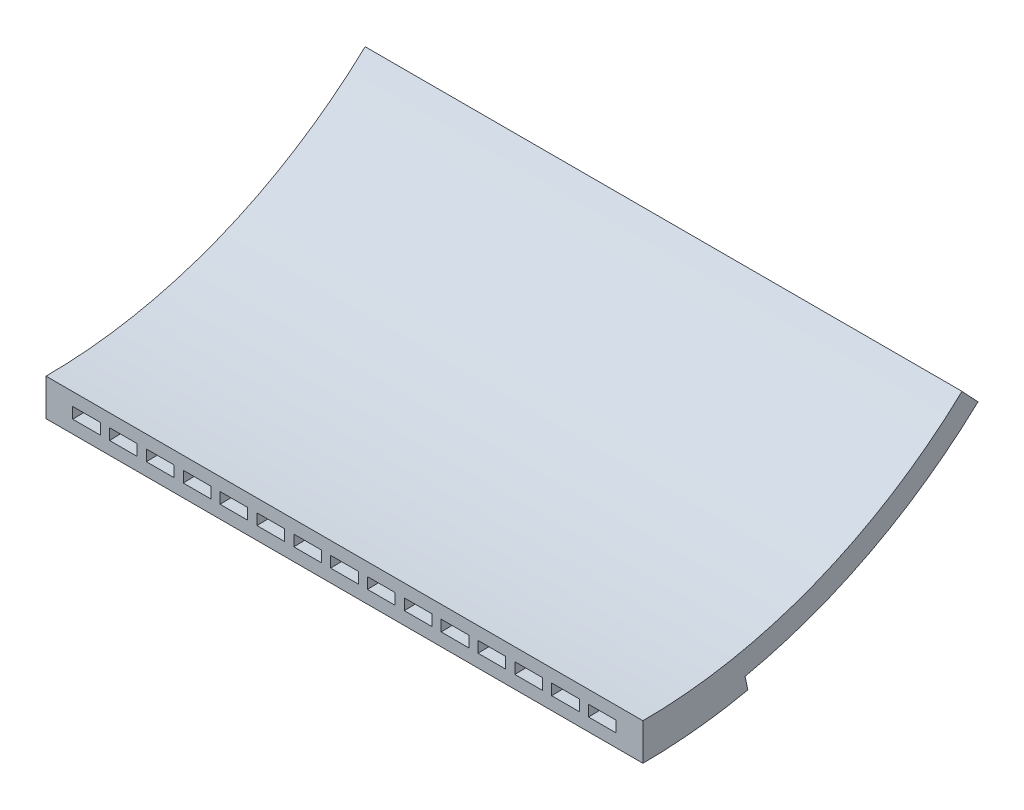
from build123d import *

# Parameters (mm, degrees)
SKICA1_W                 = 162
SKICA1_H                 = 10
SKICA1_W_2               = 7.5
SKICA1_H_2               = 3
ROTOVAT1_ANGLE           = 140
M_TKO1_SCALE             = 0.655
ODEBRAT_VYSUNUT_M1_DEPTH = 210.05737826
ODEBRAT_VYSUNUT_M2_DEPTH = 126.349441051


with BuildPart() as part:
    # Skica1 → Rotovat1 (revolve)
    with BuildSketch(Plane.XY):
        with Locations((73.75, 1.5)):
            Rectangle(SKICA1_W, SKICA1_H)
        with Locations((13.75, 1.5)):
            Rectangle(SKICA1_W_2, SKICA1_H_2, mode=Mode.SUBTRACT)
        with Locations((3.75, 1.5)):
            Rectangle(SKICA1_W_2, SKICA1_H_2, mode=Mode.SUBTRACT)
        with Locations((23.75, 1.5)):
            Rectangle(SKICA1_W_2, SKICA1_H_2, mode=Mode.SUBTRACT)
        with Locations((33.75, 1.5)):
            Rectangle(SKICA1_W_2, SKICA1_H_2, mode=Mode.SUBTRACT)
        with Locations((43.75, 1.5)):
            Rectangle(SKICA1_W_2, SKICA1_H_2, mode=Mode.SUBTRACT)
        with Locations((53.75, 1.5)):
            Rectangle(SKICA1_W_2, SKICA1_H_2, mode=Mode.SUBTRACT)
        with Locations((63.75, 1.5)):
            Rectangle(SKICA1_W_2, SKICA1_H_2, mode=Mode.SUBTRACT)
        with Locations((73.75, 1.5)):
            Rectangle(SKICA1_W_2, SKICA1_H_2, mode=Mode.SUBTRACT)
        with Locations((83.75, 1.5)):
            Rectangle(SKICA1_W_2, SKICA1_H_2, mode=Mode.SUBTRACT)
        with Locations((93.75, 1.5)):
            Rectangle(SKICA1_W_2, SKICA1_H_2, mode=Mode.SUBTRACT)
        with Locations((103.75, 1.5)):
            Rectangle(SKICA1_W_2, SKICA1_H_2, mode=Mode.SUBTRACT)
        with Locations((113.75, 1.5)):
            Rectangle(SKICA1_W_2, SKICA1_H_2, mode=Mode.SUBTRACT)
        with Locations((123.75, 1.5)):
            Rectangle(SKICA1_W_2, SKICA1_H_2, mode=Mode.SUBTRACT)
        with Locations((133.75, 1.5)):
            Rectangle(SKICA1_W_2, SKICA1_H_2, mode=Mode.SUBTRACT)
        with Locations((143.75, 1.5)):
            Rectangle(SKICA1_W_2, SKICA1_H_2, mode=Mode.SUBTRACT)
    revolve(axis=Axis((-7.25, 133.5, 0), (1, 0, 0)), revolution_arc=ROTOVAT1_ANGLE)


with BuildPart() as part_1:
    # M_tko1: scaled about (0, 0, 0)
    add(part.part.scale(M_TKO1_SCALE))

    # Skica7 → Odebrat vysunut_m1 (cut, through all)
    with BuildSketch(Plane(origin=(101.36125, 0, 0), x_dir=(0, 0, -1), z_dir=(1, 0, 0))):
        with BuildLine():
            ThreePointArc((61.19912284, 21.814475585), (89.704250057, 89.791488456), (57.680546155, 156.183498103))
            Line((57.680546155, 156.183498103), (53.470287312, 151.165907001))
            ThreePointArc((53.470287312, 151.165907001), (83.156494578, 89.620029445), (56.732033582, 26.604842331))
            Line((56.732033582, 26.604842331), (61.19912284, 21.814475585))
        make_face()
    extrude(amount=-ODEBRAT_VYSUNUT_M1_DEPTH, mode=Mode.SUBTRACT)

    # Skica8 → Odebrat vysunut_m2 (cut, through all)
    with BuildSketch(Plane(origin=(101.36125, 0, 0), x_dir=(0, 0, -1), z_dir=(1, 0, 0))):
        with BuildLine():
            ThreePointArc((59.567441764, 23.564239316), (40.330278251, 9.968756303), (18.159526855, 2.008643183))
            Line((18.159526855, 2.008643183), (18.656955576, -0.331574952))
            ThreePointArc((18.656955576, -0.331574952), (41.435011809, 7.846582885), (61.19912284, 21.814475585))
            Line((61.19912284, 21.814475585), (59.567441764, 23.564239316))
        make_face()
    extrude(amount=-ODEBRAT_VYSUNUT_M2_DEPTH, mode=Mode.SUBTRACT)


solid = part_1.part
